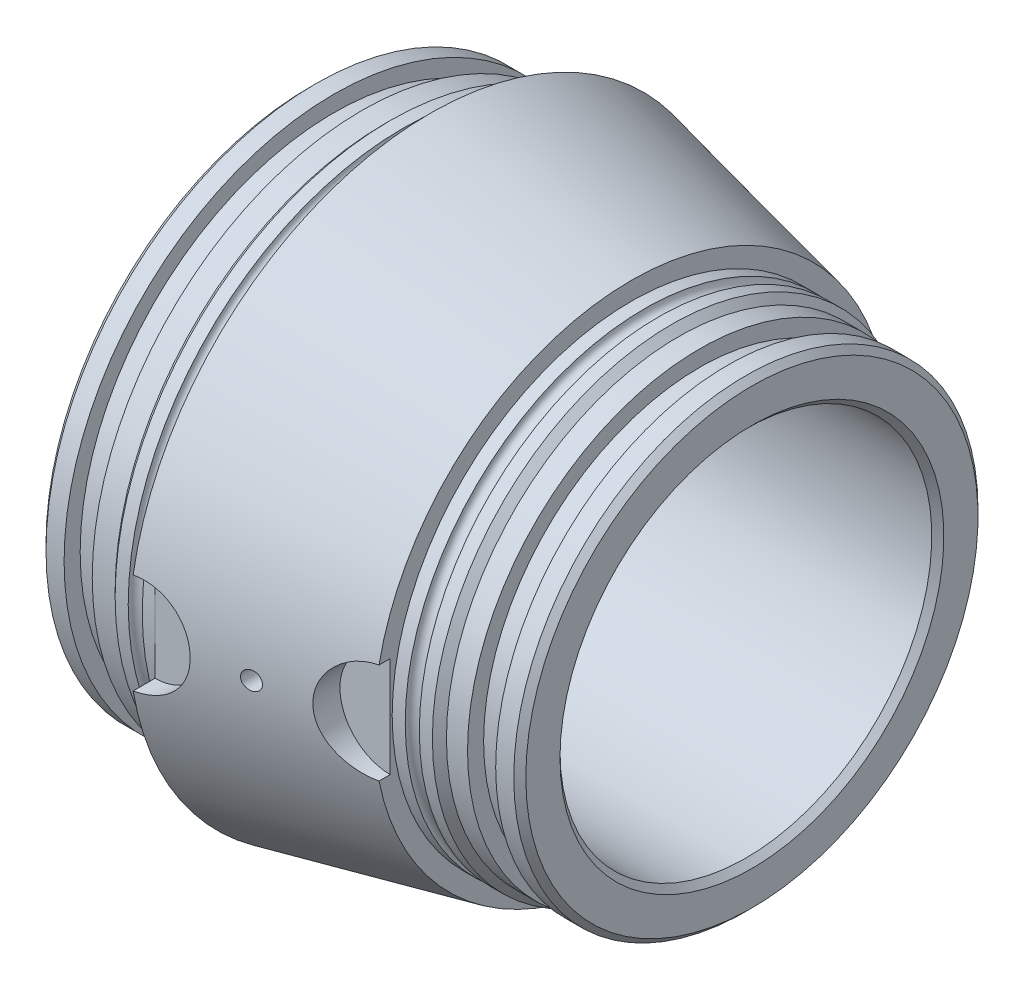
ISO-10303-21;
HEADER;
FILE_DESCRIPTION(('STEP AP214'),'2;1');
FILE_NAME('part.step','',(''),(''),'','','');
FILE_SCHEMA(('AUTOMOTIVE_DESIGN { 1 0 10303 214 1 1 1 1 }'));
ENDSEC;
DATA;
#1=APPLICATION_CONTEXT('core data for automotive mechanical design processes');
#2=APPLICATION_PROTOCOL_DEFINITION('international standard','automotive_design',2000,#1);
#3=PRODUCT_CONTEXT('',#1,'mechanical');
#4=PRODUCT('Part','Part','',(#3));
#5=PRODUCT_RELATED_PRODUCT_CATEGORY('part','',(#4));
#6=PRODUCT_DEFINITION_FORMATION('','',#4);
#7=PRODUCT_DEFINITION_CONTEXT('part definition',#1,'design');
#8=PRODUCT_DEFINITION('design','',#6,#7);
#9=PRODUCT_DEFINITION_SHAPE('','',#8);
#10=(LENGTH_UNIT() NAMED_UNIT(*) SI_UNIT(.MILLI.,.METRE.));
#11=(NAMED_UNIT(*) PLANE_ANGLE_UNIT() SI_UNIT($,.RADIAN.));
#12=(NAMED_UNIT(*) SI_UNIT($,.STERADIAN.) SOLID_ANGLE_UNIT());
#13=UNCERTAINTY_MEASURE_WITH_UNIT(LENGTH_MEASURE(1.E-05),#10,'distance_accuracy_value','');
#14=(GEOMETRIC_REPRESENTATION_CONTEXT(3) GLOBAL_UNCERTAINTY_ASSIGNED_CONTEXT((#13)) GLOBAL_UNIT_ASSIGNED_CONTEXT((#10,
#11,#12)) REPRESENTATION_CONTEXT('',''));
#15=CARTESIAN_POINT('',(0.,0.,0.));
#16=DIRECTION('',(0.,0.,1.));
#17=DIRECTION('',(1.,0.,0.));
#18=AXIS2_PLACEMENT_3D('',#15,#16,#17);
#19=CARTESIAN_POINT('',(0.,0.,0.));
#20=DIRECTION('',(-1.,0.,0.));
#21=DIRECTION('',(0.,0.,1.));
#22=AXIS2_PLACEMENT_3D('',#19,#20,#21);
#23=CONICAL_SURFACE('',#22,32.512,0.216550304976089);
#24=CARTESIAN_POINT('',(-25.4002,-6.34999999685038,37.5671512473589));
#25=CARTESIAN_POINT('',(-25.2239974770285,-6.35002386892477,37.5278230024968));
#26=CARTESIAN_POINT('',(-25.0475169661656,-6.34267756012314,37.4896959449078));
#27=CARTESIAN_POINT('',(-24.6952205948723,-6.31323789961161,37.4160715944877));
#28=CARTESIAN_POINT('',(-24.5194048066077,-6.29114299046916,37.3805745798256));
#29=CARTESIAN_POINT('',(-24.1697028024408,-6.23220054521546,37.3124473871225));
#30=CARTESIAN_POINT('',(-23.9958165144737,-6.19535356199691,37.2798171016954));
#31=CARTESIAN_POINT('',(-23.6512532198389,-6.10704582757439,37.2175698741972));
#32=CARTESIAN_POINT('',(-23.4805760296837,-6.05558591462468,37.1879527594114));
#33=CARTESIAN_POINT('',(-23.1435218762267,-5.93823923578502,37.1317789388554));
#34=CARTESIAN_POINT('',(-22.9771497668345,-5.872336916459,37.1052255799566));
#35=CARTESIAN_POINT('',(-22.6501172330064,-5.72649204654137,37.0552141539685));
#36=CARTESIAN_POINT('',(-22.4894589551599,-5.64654428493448,37.0317572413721));
#37=CARTESIAN_POINT('',(-22.1753124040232,-5.4732115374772,36.9879084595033));
#38=CARTESIAN_POINT('',(-22.0218178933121,-5.37983854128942,36.967513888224));
#39=CARTESIAN_POINT('',(-21.722994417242,-5.1801958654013,36.9296341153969));
#40=CARTESIAN_POINT('',(-21.5776684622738,-5.07392147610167,36.9121499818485));
#41=CARTESIAN_POINT('',(-21.2986594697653,-4.85106866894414,36.880183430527));
#42=CARTESIAN_POINT('',(-21.164826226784,-4.73468453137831,36.8656570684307));
#43=CARTESIAN_POINT('',(-20.9071917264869,-4.49094983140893,36.8390435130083));
#44=CARTESIAN_POINT('',(-20.783394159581,-4.36359527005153,36.8269572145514));
#45=CARTESIAN_POINT('',(-20.5468337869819,-4.09887583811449,36.8049951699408));
#46=CARTESIAN_POINT('',(-20.4340694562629,-3.96151235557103,36.795119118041));
#47=CARTESIAN_POINT('',(-20.2203561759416,-3.67768398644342,36.777320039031));
#48=CARTESIAN_POINT('',(-20.1194116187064,-3.53121574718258,36.7693977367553));
#49=CARTESIAN_POINT('',(-19.9304586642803,-3.23078923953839,36.7552804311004));
#50=CARTESIAN_POINT('',(-19.8424068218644,-3.07685856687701,36.7490795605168));
#51=CARTESIAN_POINT('',(-19.6794349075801,-2.76207507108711,36.7381240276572));
#52=CARTESIAN_POINT('',(-19.6045196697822,-2.60121972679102,36.7333698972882));
#53=CARTESIAN_POINT('',(-19.4684311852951,-2.27385138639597,36.7250899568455));
#54=CARTESIAN_POINT('',(-19.4072518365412,-2.10734094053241,36.7215636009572));
#55=CARTESIAN_POINT('',(-19.299010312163,-1.76970752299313,36.7155425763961));
#56=CARTESIAN_POINT('',(-19.2519533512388,-1.59858287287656,36.7130482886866));
#57=CARTESIAN_POINT('',(-19.1721761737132,-1.25235213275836,36.7089309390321));
#58=CARTESIAN_POINT('',(-19.1395091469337,-1.07723374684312,36.7073111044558));
#59=CARTESIAN_POINT('',(-19.0889973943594,-0.724862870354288,36.704845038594));
#60=CARTESIAN_POINT('',(-19.0711530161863,-0.547610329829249,36.7039988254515));
#61=CARTESIAN_POINT('',(-19.0504147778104,-0.192225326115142,36.7030179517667));
#62=CARTESIAN_POINT('',(-19.0475213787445,-0.0140928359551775,36.7028833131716));
#63=CARTESIAN_POINT('',(-19.0567069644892,0.341784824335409,36.7033155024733));
#64=CARTESIAN_POINT('',(-19.0687859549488,0.519529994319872,36.7038823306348));
#65=CARTESIAN_POINT('',(-19.1078645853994,0.873685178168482,36.7057613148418));
#66=CARTESIAN_POINT('',(-19.1348904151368,1.05009229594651,36.707074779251));
#67=CARTESIAN_POINT('',(-19.2036863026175,1.3999954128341,36.7105413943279));
#68=CARTESIAN_POINT('',(-19.2454560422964,1.57349147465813,36.712694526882));
#69=CARTESIAN_POINT('',(-19.3434490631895,1.91637406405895,36.7179817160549));
#70=CARTESIAN_POINT('',(-19.3996751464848,2.08575978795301,36.7211159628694));
#71=CARTESIAN_POINT('',(-19.5261471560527,2.419115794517,36.7285462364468));
#72=CARTESIAN_POINT('',(-19.5963878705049,2.58308806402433,36.7328418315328));
#73=CARTESIAN_POINT('',(-19.7503718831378,2.9044694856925,36.7428100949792));
#74=CARTESIAN_POINT('',(-19.834111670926,3.06188033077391,36.7484824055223));
#75=CARTESIAN_POINT('',(-20.0144602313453,3.36900006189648,36.7614427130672));
#76=CARTESIAN_POINT('',(-20.111064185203,3.51871180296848,36.768730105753));
#77=CARTESIAN_POINT('',(-20.3164844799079,3.80947032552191,36.7851783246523));
#78=CARTESIAN_POINT('',(-20.4253046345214,3.95051437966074,36.7943397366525));
#79=CARTESIAN_POINT('',(-20.6542785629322,4.22282625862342,36.8147868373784));
#80=CARTESIAN_POINT('',(-20.7744280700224,4.35409773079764,36.8260717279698));
#81=CARTESIAN_POINT('',(-21.0247990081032,4.60559462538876,36.8509740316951));
#82=CARTESIAN_POINT('',(-21.1549877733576,4.72585330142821,36.8645840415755));
#83=CARTESIAN_POINT('',(-21.424733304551,4.95490154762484,36.8943747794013));
#84=CARTESIAN_POINT('',(-21.5642865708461,5.06369536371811,36.9105545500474));
#85=CARTESIAN_POINT('',(-21.8518246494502,5.26917386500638,36.945681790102));
#86=CARTESIAN_POINT('',(-21.9998139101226,5.36585207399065,36.9646307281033));
#87=CARTESIAN_POINT('',(-22.302978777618,5.54635655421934,37.0054205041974));
#88=CARTESIAN_POINT('',(-22.4581517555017,5.63018747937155,37.0272602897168));
#89=CARTESIAN_POINT('',(-22.7744166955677,5.78443936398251,37.0738980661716));
#90=CARTESIAN_POINT('',(-22.9355030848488,5.85487258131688,37.0986933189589));
#91=CARTESIAN_POINT('',(-23.262470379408,5.9819915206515,37.1512693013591));
#92=CARTESIAN_POINT('',(-23.4283495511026,6.03868214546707,37.1790489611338));
#93=CARTESIAN_POINT('',(-23.7636213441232,6.13802208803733,37.2375348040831));
#94=CARTESIAN_POINT('',(-23.93301143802,6.1806811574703,37.2682389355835));
#95=CARTESIAN_POINT('',(-24.2741491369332,6.25182396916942,37.3324680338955));
#96=CARTESIAN_POINT('',(-24.4458957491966,6.28031350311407,37.3659918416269));
#97=CARTESIAN_POINT('',(-24.7483321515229,6.31783339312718,37.427144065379));
#98=CARTESIAN_POINT('',(-24.8787671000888,6.32992175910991,37.4542034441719));
#99=CARTESIAN_POINT('',(-25.1395808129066,6.34600108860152,37.5096766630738));
#100=CARTESIAN_POINT('',(-25.2699591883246,6.35000783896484,37.5380877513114));
#101=CARTESIAN_POINT('',(-25.4002,6.34999999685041,37.5671512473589));
#102=B_SPLINE_CURVE_WITH_KNOTS('',3,(#24,#25,#26,#27,#28,#29,#30,#31,#32,#33,#34,#35,#36,#37,
#38,#39,#40,#41,#42,#43,#44,#45,#46,#47,#48,#49,#50,#51,#52,#53,#54,#55,#56,#57,#58,#59,#60,#61,
#62,#63,#64,#65,#66,#67,#68,#69,#70,#71,#72,#73,#74,#75,#76,#77,#78,#79,#80,#81,#82,#83,#84,#85,
#86,#87,#88,#89,#90,#91,#92,#93,#94,#95,#96,#97,#98,#99,#100,#101),.UNSPECIFIED.,.F.,.F.,(4,2,2,
2,2,2,2,2,2,2,2,2,2,2,2,2,2,2,2,2,2,2,2,2,2,2,2,2,2,2,2,2,2,2,2,2,2,2,4),(0.,0.541474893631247,
1.08300697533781,1.62451876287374,2.16599949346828,2.70806625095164,3.25033454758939,
3.79212153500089,4.33410689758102,4.86733322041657,5.40075474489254,5.93410243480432,
6.46764769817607,6.99935149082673,7.53125053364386,8.06291281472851,8.59477117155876,
9.12857928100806,9.66239990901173,10.1962370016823,10.7300742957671,11.2648499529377,
11.7996140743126,12.3344819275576,12.8691512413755,13.403681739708,13.9380125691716,
14.4725106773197,15.0068082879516,15.539435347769,16.0718644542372,16.6045769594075,
17.137096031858,17.6691255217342,18.2009649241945,18.7324339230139,19.2636855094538,
19.6647228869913,20.064976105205),.UNSPECIFIED.);
#103=CARTESIAN_POINT('',(-25.4,-6.34999999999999,37.5671066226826));
#104=VERTEX_POINT('',#103);
#105=CARTESIAN_POINT('',(-25.4,6.35000000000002,37.5671066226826));
#106=VERTEX_POINT('',#105);
#107=EDGE_CURVE('E187',#104,#106,#102,.T.);
#108=ORIENTED_EDGE('',*,*,#107,.F.);
#109=CARTESIAN_POINT('',(-25.4,0.,0.));
#110=DIRECTION('',(-1.,0.,0.));
#111=DIRECTION('',(0.,0.,1.));
#112=AXIS2_PLACEMENT_3D('',#109,#110,#111);
#113=CIRCLE('',#112,38.1);
#114=EDGE_CURVE('E112',#106,#104,#113,.T.);
#115=ORIENTED_EDGE('',*,*,#114,.F.);
#116=EDGE_LOOP('',(#108,#115));
#117=FACE_BOUND('',#116,.T.);
#118=CARTESIAN_POINT('',(0.000200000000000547,6.34999999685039,31.8858084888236));
#119=CARTESIAN_POINT('',(-0.184691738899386,6.35002215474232,31.927266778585));
#120=CARTESIAN_POINT('',(-0.369214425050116,6.34193755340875,31.9702779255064));
#121=CARTESIAN_POINT('',(-0.736193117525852,6.3098636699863,32.0589183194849));
#122=CARTESIAN_POINT('',(-0.918649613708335,6.28587824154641,32.1045469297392));
#123=CARTESIAN_POINT('',(-1.28003891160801,6.22234980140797,32.1978985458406));
#124=CARTESIAN_POINT('',(-1.45897571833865,6.18282569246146,32.2456189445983));
#125=CARTESIAN_POINT('',(-1.81237478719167,6.0886153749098,32.3426574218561));
#126=CARTESIAN_POINT('',(-1.98683683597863,6.03392844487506,32.391975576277));
#127=CARTESIAN_POINT('',(-2.33003328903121,5.90988302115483,32.4915814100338));
#128=CARTESIAN_POINT('',(-2.49877146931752,5.84053442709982,32.5418684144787));
#129=CARTESIAN_POINT('',(-2.82963142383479,5.68761037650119,32.6428323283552));
#130=CARTESIAN_POINT('',(-2.99175074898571,5.60402971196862,32.693509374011));
#131=CARTESIAN_POINT('',(-3.30825646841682,5.42320516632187,32.7945689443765));
#132=CARTESIAN_POINT('',(-3.46264361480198,5.32596261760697,32.8449514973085));
#133=CARTESIAN_POINT('',(-3.76274354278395,5.11835547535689,32.9447585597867));
#134=CARTESIAN_POINT('',(-3.90845330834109,5.00798635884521,32.9941827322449));
#135=CARTESIAN_POINT('',(-4.1922282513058,4.77306499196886,33.0920693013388));
#136=CARTESIAN_POINT('',(-4.33014864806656,4.64832725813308,33.1405066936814));
#137=CARTESIAN_POINT('',(-4.59493343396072,4.38676598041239,33.2349003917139));
#138=CARTESIAN_POINT('',(-4.7217982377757,4.24994289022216,33.2808567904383));
#139=CARTESIAN_POINT('',(-4.9634704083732,3.96501731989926,33.3695452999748));
#140=CARTESIAN_POINT('',(-5.07827600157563,3.81691318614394,33.4122769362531));
#141=CARTESIAN_POINT('',(-5.29474916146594,3.5104566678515,33.4937475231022));
#142=CARTESIAN_POINT('',(-5.39642261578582,3.35210892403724,33.5324882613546));
#143=CARTESIAN_POINT('',(-5.5823968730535,3.03189969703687,33.6040076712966));
#144=CARTESIAN_POINT('',(-5.66718109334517,2.8703550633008,33.636947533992));
#145=CARTESIAN_POINT('',(-5.82279657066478,2.53985873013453,33.6978473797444));
#146=CARTESIAN_POINT('',(-5.89363406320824,2.37091038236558,33.7258095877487));
#147=CARTESIAN_POINT('',(-6.02063762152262,2.02683110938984,33.7762259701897));
#148=CARTESIAN_POINT('',(-6.07680717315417,1.85170166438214,33.7986814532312));
#149=CARTESIAN_POINT('',(-6.17385816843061,1.496611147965,33.8376370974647));
#150=CARTESIAN_POINT('',(-6.21474060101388,1.31665038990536,33.8541376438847));
#151=CARTESIAN_POINT('',(-6.27845952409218,0.965916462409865,33.8799183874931));
#152=CARTESIAN_POINT('',(-6.30234473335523,0.795363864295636,33.8896175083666));
#153=CARTESIAN_POINT('',(-6.33618521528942,0.452658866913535,33.9033724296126));
#154=CARTESIAN_POINT('',(-6.34614115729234,0.280506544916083,33.9074285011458));
#155=CARTESIAN_POINT('',(-6.35201392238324,-0.0640404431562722,33.909820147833));
#156=CARTESIAN_POINT('',(-6.34793364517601,-0.236435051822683,33.9081569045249));
#157=CARTESIAN_POINT('',(-6.32578532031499,-0.580172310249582,33.8991442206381));
#158=CARTESIAN_POINT('',(-6.3077174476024,-0.751514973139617,33.891794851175));
#159=CARTESIAN_POINT('',(-6.25874901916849,-1.08532024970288,33.8719375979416));
#160=CARTESIAN_POINT('',(-6.22836641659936,-1.24787164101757,33.8596380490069));
#161=CARTESIAN_POINT('',(-6.15513331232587,-1.56973984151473,33.8301152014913));
#162=CARTESIAN_POINT('',(-6.11227870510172,-1.7290555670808,33.8128902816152));
#163=CARTESIAN_POINT('',(-6.01452226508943,-2.04330420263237,33.7738104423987));
#164=CARTESIAN_POINT('',(-5.95962413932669,-2.19823844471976,33.7519569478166));
#165=CARTESIAN_POINT('',(-5.83823786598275,-2.50287335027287,33.7039570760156));
#166=CARTESIAN_POINT('',(-5.77174533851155,-2.65257201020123,33.6778090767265));
#167=CARTESIAN_POINT('',(-5.62592113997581,-2.94950043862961,33.6209166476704));
#168=CARTESIAN_POINT('',(-5.54630827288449,-3.09657305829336,33.5900730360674));
#169=CARTESIAN_POINT('',(-5.37611482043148,-3.38344806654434,33.5247586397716));
#170=CARTESIAN_POINT('',(-5.28553020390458,-3.52324775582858,33.4902865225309));
#171=CARTESIAN_POINT('',(-5.0941048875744,-3.79475575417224,33.4182259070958));
#172=CARTESIAN_POINT('',(-4.99326604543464,-3.92646552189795,33.3806379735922));
#173=CARTESIAN_POINT('',(-4.78201731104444,-4.18117503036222,33.3028531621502));
#174=CARTESIAN_POINT('',(-4.67160399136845,-4.30417162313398,33.262655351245));
#175=CARTESIAN_POINT('',(-4.31226541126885,-4.67438857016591,33.1336172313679));
#176=CARTESIAN_POINT('',(-4.04753315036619,-4.90530882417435,33.0410348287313));
#177=CARTESIAN_POINT('',(-3.48462904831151,-5.31998005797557,32.8513723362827));
#178=CARTESIAN_POINT('',(-3.18643527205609,-5.50369983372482,32.7542893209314));
#179=CARTESIAN_POINT('',(-2.71148763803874,-5.74492776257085,32.6064189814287));
#180=CARTESIAN_POINT('',(-2.54399893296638,-5.8210330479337,32.5554517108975));
#181=CARTESIAN_POINT('',(-2.20287604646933,-5.95849062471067,32.4542763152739));
#182=CARTESIAN_POINT('',(-2.0292440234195,-6.01984803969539,32.4040679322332));
#183=CARTESIAN_POINT('',(-1.6771674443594,-6.12727153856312,32.3050926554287));
#184=CARTESIAN_POINT('',(-1.49872885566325,-6.17335571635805,32.2563241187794));
#185=CARTESIAN_POINT('',(-1.13808929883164,-6.24989627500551,32.1607601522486));
#186=CARTESIAN_POINT('',(-0.955890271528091,-6.28036051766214,32.1139637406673));
#187=CARTESIAN_POINT('',(-0.644504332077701,-6.31852285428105,32.0366477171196));
#188=CARTESIAN_POINT('',(-0.515964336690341,-6.33032085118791,32.0054887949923));
#189=CARTESIAN_POINT('',(-0.258277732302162,-6.34605675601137,31.9445740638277));
#190=CARTESIAN_POINT('',(-0.12913231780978,-6.35000639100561,31.9148162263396));
#191=CARTESIAN_POINT('',(0.000200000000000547,-6.34999999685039,31.8858084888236));
#192=B_SPLINE_CURVE_WITH_KNOTS('',3,(#118,#119,#120,#121,#122,#123,#124,#125,#126,#127,#128,
#129,#130,#131,#132,#133,#134,#135,#136,#137,#138,#139,#140,#141,#142,#143,#144,#145,#146,#147,
#148,#149,#150,#151,#152,#153,#154,#155,#156,#157,#158,#159,#160,#161,#162,#163,#164,#165,#166,
#167,#168,#169,#170,#171,#172,#173,#174,#175,#176,#177,#178,#179,#180,#181,#182,#183,#184,#185,
#186,#187,#188,#189,#190,#191),.UNSPECIFIED.,.F.,.F.,(4,2,2,2,2,2,2,2,2,2,2,2,2,2,2,2,2,2,2,2,2,
2,2,2,2,2,2,2,2,2,2,2,2,2,2,2,4),(0.,0.568239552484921,1.13634143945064,1.70375436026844,
2.27119428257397,2.83825228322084,3.40551823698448,3.97272890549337,4.54013558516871,
5.11592680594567,5.69169642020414,6.26755059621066,6.84314569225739,7.39859919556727,
7.95380379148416,8.50887632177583,9.06391293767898,9.58073297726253,10.097528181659,
10.6142166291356,11.1308986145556,11.6277932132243,12.1248515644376,12.6217571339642,
13.1188508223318,13.6284647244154,14.1382664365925,14.6479759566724,15.1578686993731,
16.2426728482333,17.328192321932,17.9003175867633,18.4722438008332,19.0434900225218,
19.6144484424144,20.0125849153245,20.410126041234),.UNSPECIFIED.);
#193=CARTESIAN_POINT('',(0.,6.35,31.8858533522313));
#194=VERTEX_POINT('',#193);
#195=CARTESIAN_POINT('',(0.,-6.35,31.8858533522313));
#196=VERTEX_POINT('',#195);
#197=EDGE_CURVE('E92',#194,#196,#192,.T.);
#198=ORIENTED_EDGE('',*,*,#197,.F.);
#199=CARTESIAN_POINT('',(0.,0.,0.));
#200=DIRECTION('',(-1.,0.,0.));
#201=DIRECTION('',(0.,0.,1.));
#202=AXIS2_PLACEMENT_3D('',#199,#200,#201);
#203=CIRCLE('',#202,32.512);
#204=EDGE_CURVE('E97',#194,#196,#203,.T.);
#205=ORIENTED_EDGE('',*,*,#204,.T.);
#206=EDGE_LOOP('',(#198,#205));
#207=FACE_BOUND('',#206,.T.);
#208=CARTESIAN_POINT('',(-13.6580475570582,-0.623372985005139,35.5112994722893));
#209=CARTESIAN_POINT('',(-13.6226280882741,-0.677802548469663,35.5025504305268));
#210=CARTESIAN_POINT('',(-13.5826073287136,-0.729130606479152,35.4927169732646));
#211=CARTESIAN_POINT('',(-13.4946415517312,-0.824134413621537,35.4712808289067));
#212=CARTESIAN_POINT('',(-13.4466843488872,-0.867798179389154,35.4596754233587));
#213=CARTESIAN_POINT('',(-13.3443957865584,-0.946228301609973,35.4351577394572));
#214=CARTESIAN_POINT('',(-13.2900747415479,-0.981008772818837,35.4222475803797));
#215=CARTESIAN_POINT('',(-13.1765622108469,-1.04089172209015,35.3955550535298));
#216=CARTESIAN_POINT('',(-13.1173720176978,-1.06599675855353,35.3817729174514));
#217=CARTESIAN_POINT('',(-12.9946007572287,-1.10630435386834,35.3535129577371));
#218=CARTESIAN_POINT('',(-12.930958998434,-1.12131650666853,35.3390270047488));
#219=CARTESIAN_POINT('',(-12.8020455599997,-1.14029883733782,35.3100438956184));
#220=CARTESIAN_POINT('',(-12.7367736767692,-1.14426762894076,35.2955467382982));
#221=CARTESIAN_POINT('',(-12.605765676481,-1.14101018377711,35.2668153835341));
#222=CARTESIAN_POINT('',(-12.5400313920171,-1.13367230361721,35.2525852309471));
#223=CARTESIAN_POINT('',(-12.4106448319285,-1.1077344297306,35.2249306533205));
#224=CARTESIAN_POINT('',(-12.3469925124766,-1.08913467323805,35.2115062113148));
#225=CARTESIAN_POINT('',(-12.2240899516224,-1.04128592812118,35.1859030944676));
#226=CARTESIAN_POINT('',(-12.164811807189,-1.01211304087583,35.1737162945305));
#227=CARTESIAN_POINT('',(-12.0519627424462,-0.943845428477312,35.1507785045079));
#228=CARTESIAN_POINT('',(-11.9983912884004,-0.904751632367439,35.1400273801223));
#229=CARTESIAN_POINT('',(-11.899530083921,-0.818488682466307,35.1203859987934));
#230=CARTESIAN_POINT('',(-11.8541093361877,-0.771476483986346,35.1114658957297));
#231=CARTESIAN_POINT('',(-11.7718201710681,-0.67021345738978,35.0954376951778));
#232=CARTESIAN_POINT('',(-11.7349508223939,-0.615963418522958,35.0883294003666));
#233=CARTESIAN_POINT('',(-11.6715784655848,-0.502907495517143,35.0761866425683));
#234=CARTESIAN_POINT('',(-11.6448873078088,-0.444211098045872,35.0711144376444));
#235=CARTESIAN_POINT('',(-11.6017173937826,-0.323046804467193,35.0629418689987));
#236=CARTESIAN_POINT('',(-11.5852377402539,-0.260579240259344,35.0598413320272));
#237=CARTESIAN_POINT('',(-11.5631771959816,-0.134593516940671,35.0556963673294));
#238=CARTESIAN_POINT('',(-11.5574459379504,-0.0711025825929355,35.0546235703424));
#239=CARTESIAN_POINT('',(-11.5566042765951,0.0559507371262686,35.0544658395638));
#240=CARTESIAN_POINT('',(-11.5614934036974,0.119513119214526,35.0553808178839));
#241=CARTESIAN_POINT('',(-11.5816827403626,0.244550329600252,35.0591727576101));
#242=CARTESIAN_POINT('',(-11.5969271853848,0.306034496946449,35.0620392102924));
#243=CARTESIAN_POINT('',(-11.637295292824,0.425541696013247,35.0696741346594));
#244=CARTESIAN_POINT('',(-11.662418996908,0.483564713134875,35.0744426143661));
#245=CARTESIAN_POINT('',(-11.7219012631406,0.594781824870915,35.0858213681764));
#246=CARTESIAN_POINT('',(-11.756298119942,0.647954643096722,35.0924392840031));
#247=CARTESIAN_POINT('',(-11.83323878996,0.747760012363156,35.1073853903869));
#248=CARTESIAN_POINT('',(-11.8757830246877,0.79439222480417,35.1157136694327));
#249=CARTESIAN_POINT('',(-11.9683619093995,0.880454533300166,35.1340357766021));
#250=CARTESIAN_POINT('',(-12.0184859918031,0.919784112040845,35.1440496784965));
#251=CARTESIAN_POINT('',(-12.1243479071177,0.989490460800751,35.1654551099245));
#252=CARTESIAN_POINT('',(-12.1800862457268,1.01986642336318,35.1768467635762));
#253=CARTESIAN_POINT('',(-12.2966901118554,1.0714144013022,35.2009796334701));
#254=CARTESIAN_POINT('',(-12.357632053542,1.09240358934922,35.213742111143));
#255=CARTESIAN_POINT('',(-12.481996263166,1.12384991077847,35.2401266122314));
#256=CARTESIAN_POINT('',(-12.5454187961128,1.13430591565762,35.2537487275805));
#257=CARTESIAN_POINT('',(-12.6742037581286,1.14456691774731,35.2817647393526));
#258=CARTESIAN_POINT('',(-12.7395802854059,1.14416909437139,35.2961683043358));
#259=CARTESIAN_POINT('',(-12.8692887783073,1.13226884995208,35.3251025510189));
#260=CARTESIAN_POINT('',(-12.9336206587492,1.1207655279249,35.3396332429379));
#261=CARTESIAN_POINT('',(-13.0601001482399,1.08678787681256,35.3685331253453));
#262=CARTESIAN_POINT('',(-13.1222188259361,1.06420296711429,35.3828991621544));
#263=CARTESIAN_POINT('',(-13.2417903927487,1.00859278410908,35.410844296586));
#264=CARTESIAN_POINT('',(-13.2992432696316,0.97556748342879,35.4244233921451));
#265=CARTESIAN_POINT('',(-13.4074548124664,0.900155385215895,35.4502336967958));
#266=CARTESIAN_POINT('',(-13.4582513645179,0.857825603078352,35.4624724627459));
#267=CARTESIAN_POINT('',(-13.5519793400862,0.764812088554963,35.4852251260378));
#268=CARTESIAN_POINT('',(-13.5949116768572,0.714129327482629,35.4957392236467));
#269=CARTESIAN_POINT('',(-13.6706425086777,0.607046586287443,35.5143932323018));
#270=CARTESIAN_POINT('',(-13.7036475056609,0.550801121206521,35.5225812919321));
#271=CARTESIAN_POINT('',(-13.7596969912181,0.433274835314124,35.5365407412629));
#272=CARTESIAN_POINT('',(-13.7827436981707,0.371995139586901,35.5423126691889));
#273=CARTESIAN_POINT('',(-13.8175687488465,0.248024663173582,35.5510524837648));
#274=CARTESIAN_POINT('',(-13.8296504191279,0.185424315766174,35.5540958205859));
#275=CARTESIAN_POINT('',(-13.843244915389,0.0589990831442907,35.5575210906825));
#276=CARTESIAN_POINT('',(-13.8447563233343,-0.00482596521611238,35.5579026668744));
#277=CARTESIAN_POINT('',(-13.8372243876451,-0.130677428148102,35.5560040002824));
#278=CARTESIAN_POINT('',(-13.8283650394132,-0.192715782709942,35.5537701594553));
#279=CARTESIAN_POINT('',(-13.8006937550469,-0.314327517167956,35.5468148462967));
#280=CARTESIAN_POINT('',(-13.7818943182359,-0.373903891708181,35.5420964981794));
#281=CARTESIAN_POINT('',(-13.7447742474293,-0.464988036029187,35.5328240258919));
#282=CARTESIAN_POINT('',(-13.7295124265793,-0.497855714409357,35.5290192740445));
#283=CARTESIAN_POINT('',(-13.6959897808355,-0.56192577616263,35.5206877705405));
#284=CARTESIAN_POINT('',(-13.6777290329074,-0.593128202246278,35.5161610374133));
#285=CARTESIAN_POINT('',(-13.6580475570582,-0.623372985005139,35.5112994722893));
#286=B_SPLINE_CURVE_WITH_KNOTS('',3,(#208,#209,#210,#211,#212,#213,#214,#215,#216,#217,#218,
#219,#220,#221,#222,#223,#224,#225,#226,#227,#228,#229,#230,#231,#232,#233,#234,#235,#236,#237,
#238,#239,#240,#241,#242,#243,#244,#245,#246,#247,#248,#249,#250,#251,#252,#253,#254,#255,#256,
#257,#258,#259,#260,#261,#262,#263,#264,#265,#266,#267,#268,#269,#270,#271,#272,#273,#274,#275,
#276,#277,#278,#279,#280,#281,#282,#283,#284,#285),.UNSPECIFIED.,.T.,.F.,(4,2,2,2,2,2,2,2,2,2,2,
2,2,2,2,2,2,2,2,2,2,2,2,2,2,2,2,2,2,2,2,2,2,2,2,2,2,2,4),(0.,0.196440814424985,
0.393186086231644,0.589616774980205,0.785995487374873,0.985982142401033,1.1859939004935,
1.38799329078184,1.58998842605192,1.79055764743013,1.99110809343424,2.18807121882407,
2.38501288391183,2.57811362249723,2.77119739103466,2.96155921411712,3.15191262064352,
3.34124899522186,3.53058616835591,3.72071753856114,3.91085874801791,4.10344938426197,
4.2960573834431,4.49226885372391,4.68850134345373,4.8884032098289,5.08832129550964,
5.29027618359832,5.49223160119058,5.69298237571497,5.89370982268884,6.08991539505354,
6.2860772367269,6.47663076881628,6.66720986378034,6.8544583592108,7.04147195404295,
7.15063068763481,7.2597866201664),.UNSPECIFIED.);
#287=CARTESIAN_POINT('',(-13.6580475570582,-0.623372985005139,35.5112994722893));
#288=VERTEX_POINT('',#287);
#289=EDGE_CURVE('E42',#288,#288,#286,.T.);
#290=ORIENTED_EDGE('',*,*,#289,.F.);
#291=EDGE_LOOP('',(#290));
#292=FACE_BOUND('',#291,.T.);
#293=ADVANCED_FACE('F38',(#117,#207,#292),#23,.T.);
#294=CARTESIAN_POINT('',(0.,0.,0.));
#295=DIRECTION('',(1.,0.,0.));
#296=DIRECTION('',(0.,0.,-1.));
#297=AXIS2_PLACEMENT_3D('',#294,#295,#296);
#298=PLANE('',#297);
#299=CARTESIAN_POINT('',(0.,0.,0.));
#300=DIRECTION('',(-1.,0.,0.));
#301=DIRECTION('',(0.,0.,1.));
#302=AXIS2_PLACEMENT_3D('',#299,#300,#301);
#303=CIRCLE('',#302,30.226);
#304=CARTESIAN_POINT('',(0.,0.,30.226));
#305=VERTEX_POINT('',#304);
#306=EDGE_CURVE('E108',#305,#305,#303,.T.);
#307=ORIENTED_EDGE('',*,*,#306,.T.);
#308=EDGE_LOOP('',(#307));
#309=FACE_BOUND('',#308,.T.);
#310=DIRECTION('',(0.,-1.,0.));
#311=VECTOR('',#310,1.);
#312=CARTESIAN_POINT('',(0.,0.,30.48));
#313=LINE('',#312,#311);
#314=CARTESIAN_POINT('',(0.,6.35,30.48));
#315=VERTEX_POINT('',#314);
#316=CARTESIAN_POINT('',(0.,-6.35,30.48));
#317=VERTEX_POINT('',#316);
#318=EDGE_CURVE('E83',#315,#317,#313,.T.);
#319=ORIENTED_EDGE('',*,*,#318,.T.);
#320=DIRECTION('',(0.,0.,-1.));
#321=VECTOR('',#320,1.);
#322=CARTESIAN_POINT('',(0.,-6.35,37.9359780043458));
#323=LINE('',#322,#321);
#324=EDGE_CURVE('E11',#317,#196,#323,.F.);
#325=ORIENTED_EDGE('',*,*,#324,.T.);
#326=ORIENTED_EDGE('',*,*,#204,.F.);
#327=DIRECTION('',(0.,0.,-1.));
#328=VECTOR('',#327,1.);
#329=CARTESIAN_POINT('',(0.,6.35,37.9359780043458));
#330=LINE('',#329,#328);
#331=EDGE_CURVE('E52',#194,#315,#330,.T.);
#332=ORIENTED_EDGE('',*,*,#331,.T.);
#333=EDGE_LOOP('',(#319,#325,#326,#332));
#334=FACE_BOUND('',#333,.T.);
#335=ADVANCED_FACE('F95',(#309,#334),#298,.T.);
#336=CARTESIAN_POINT('',(-25.4,0.,0.));
#337=DIRECTION('',(1.,0.,0.));
#338=DIRECTION('',(0.,0.,-1.));
#339=AXIS2_PLACEMENT_3D('',#336,#337,#338);
#340=PLANE('',#339);
#341=CARTESIAN_POINT('',(-25.4,0.,0.));
#342=DIRECTION('',(-1.,0.,0.));
#343=DIRECTION('',(0.,0.,1.));
#344=AXIS2_PLACEMENT_3D('',#341,#342,#343);
#345=CIRCLE('',#344,34.7599);
#346=CARTESIAN_POINT('',(-25.4,0.,34.7599));
#347=VERTEX_POINT('',#346);
#348=EDGE_CURVE('E115',#347,#347,#345,.T.);
#349=ORIENTED_EDGE('',*,*,#348,.F.);
#350=EDGE_LOOP('',(#349));
#351=FACE_BOUND('',#350,.T.);
#352=DIRECTION('',(0.,0.,-1.));
#353=VECTOR('',#352,1.);
#354=CARTESIAN_POINT('',(-25.4,-6.34999999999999,38.1));
#355=LINE('',#354,#353);
#356=CARTESIAN_POINT('',(-25.4,-6.34999999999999,34.798));
#357=VERTEX_POINT('',#356);
#358=EDGE_CURVE('E87',#357,#104,#355,.F.);
#359=ORIENTED_EDGE('',*,*,#358,.F.);
#360=DIRECTION('',(0.,-1.,0.));
#361=VECTOR('',#360,1.);
#362=CARTESIAN_POINT('',(-25.4,0.,34.798));
#363=LINE('',#362,#361);
#364=CARTESIAN_POINT('',(-25.4,6.35000000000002,34.798));
#365=VERTEX_POINT('',#364);
#366=EDGE_CURVE('E103',#365,#357,#363,.T.);
#367=ORIENTED_EDGE('',*,*,#366,.F.);
#368=DIRECTION('',(0.,0.,-1.));
#369=VECTOR('',#368,1.);
#370=CARTESIAN_POINT('',(-25.4,6.35000000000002,38.1));
#371=LINE('',#370,#369);
#372=EDGE_CURVE('E101',#106,#365,#371,.T.);
#373=ORIENTED_EDGE('',*,*,#372,.F.);
#374=ORIENTED_EDGE('',*,*,#114,.T.);
#375=EDGE_LOOP('',(#359,#367,#373,#374));
#376=FACE_BOUND('',#375,.T.);
#377=ADVANCED_FACE('F298',(#351,#376),#340,.F.);
#378=CARTESIAN_POINT('',(2.54,0.,0.));
#379=DIRECTION('',(-1.,0.,0.));
#380=DIRECTION('',(0.,0.,1.));
#381=AXIS2_PLACEMENT_3D('',#378,#379,#380);
#382=TOROIDAL_SURFACE('',#381,30.226,0.889);
#383=CARTESIAN_POINT('',(3.429,0.,0.));
#384=DIRECTION('',(-1.,0.,0.));
#385=DIRECTION('',(0.,0.,1.));
#386=AXIS2_PLACEMENT_3D('',#383,#384,#385);
#387=CIRCLE('',#386,30.226);
#388=CARTESIAN_POINT('',(3.429,0.,30.226));
#389=VERTEX_POINT('',#388);
#390=EDGE_CURVE('E184',#389,#389,#387,.T.);
#391=ORIENTED_EDGE('',*,*,#390,.T.);
#392=EDGE_LOOP('',(#391));
#393=FACE_BOUND('',#392,.T.);
#394=CARTESIAN_POINT('',(1.651,0.,0.));
#395=DIRECTION('',(-1.,0.,0.));
#396=DIRECTION('',(0.,0.,1.));
#397=AXIS2_PLACEMENT_3D('',#394,#395,#396);
#398=CIRCLE('',#397,30.226);
#399=CARTESIAN_POINT('',(1.651,0.,30.226));
#400=VERTEX_POINT('',#399);
#401=EDGE_CURVE('E105',#400,#400,#398,.T.);
#402=ORIENTED_EDGE('',*,*,#401,.F.);
#403=EDGE_LOOP('',(#402));
#404=FACE_BOUND('',#403,.T.);
#405=ADVANCED_FACE('F40',(#393,#404),#382,.F.);
#406=CARTESIAN_POINT('',(-43.0591254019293,0.,0.));
#407=DIRECTION('',(-1.,0.,0.));
#408=DIRECTION('',(0.,0.,1.));
#409=AXIS2_PLACEMENT_3D('',#406,#407,#408);
#410=CYLINDRICAL_SURFACE('',#409,30.226);
#411=ORIENTED_EDGE('',*,*,#306,.F.);
#412=EDGE_LOOP('',(#411));
#413=FACE_BOUND('',#412,.T.);
#414=ORIENTED_EDGE('',*,*,#401,.T.);
#415=EDGE_LOOP('',(#414));
#416=FACE_BOUND('',#415,.T.);
#417=ADVANCED_FACE('F296',(#413,#416),#410,.T.);
#418=CARTESIAN_POINT('',(-43.0591254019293,0.,0.));
#419=DIRECTION('',(-1.,0.,0.));
#420=DIRECTION('',(0.,0.,1.));
#421=AXIS2_PLACEMENT_3D('',#418,#419,#420);
#422=CYLINDRICAL_SURFACE('',#421,34.7599);
#423=ORIENTED_EDGE('',*,*,#348,.T.);
#424=EDGE_LOOP('',(#423));
#425=FACE_BOUND('',#424,.T.);
#426=CARTESIAN_POINT('',(-27.051,0.,0.));
#427=DIRECTION('',(-1.,0.,0.));
#428=DIRECTION('',(0.,0.,1.));
#429=AXIS2_PLACEMENT_3D('',#426,#427,#428);
#430=CIRCLE('',#429,34.7599);
#431=CARTESIAN_POINT('',(-27.051,0.,34.7599));
#432=VERTEX_POINT('',#431);
#433=EDGE_CURVE('E118',#432,#432,#430,.T.);
#434=ORIENTED_EDGE('',*,*,#433,.F.);
#435=EDGE_LOOP('',(#434));
#436=FACE_BOUND('',#435,.T.);
#437=ADVANCED_FACE('F293',(#425,#436),#422,.T.);
#438=CARTESIAN_POINT('',(-27.94,0.,0.));
#439=DIRECTION('',(-1.,0.,0.));
#440=DIRECTION('',(0.,0.,1.));
#441=AXIS2_PLACEMENT_3D('',#438,#439,#440);
#442=TOROIDAL_SURFACE('',#441,34.7599,0.888999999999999);
#443=CARTESIAN_POINT('',(-28.829,0.,0.));
#444=DIRECTION('',(-1.,0.,0.));
#445=DIRECTION('',(0.,0.,1.));
#446=AXIS2_PLACEMENT_3D('',#443,#444,#445);
#447=CIRCLE('',#446,34.7599);
#448=CARTESIAN_POINT('',(-28.829,0.,34.7599));
#449=VERTEX_POINT('',#448);
#450=EDGE_CURVE('E121',#449,#449,#447,.T.);
#451=ORIENTED_EDGE('',*,*,#450,.F.);
#452=EDGE_LOOP('',(#451));
#453=FACE_BOUND('',#452,.T.);
#454=ORIENTED_EDGE('',*,*,#433,.T.);
#455=EDGE_LOOP('',(#454));
#456=FACE_BOUND('',#455,.T.);
#457=ADVANCED_FACE('F289',(#453,#456),#442,.F.);
#458=CARTESIAN_POINT('',(-43.0591254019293,0.,0.));
#459=DIRECTION('',(-1.,0.,0.));
#460=DIRECTION('',(0.,0.,1.));
#461=AXIS2_PLACEMENT_3D('',#458,#459,#460);
#462=CYLINDRICAL_SURFACE('',#461,34.7599);
#463=ORIENTED_EDGE('',*,*,#450,.T.);
#464=EDGE_LOOP('',(#463));
#465=FACE_BOUND('',#464,.T.);
#466=CARTESIAN_POINT('',(-30.48,0.,0.));
#467=DIRECTION('',(-1.,0.,0.));
#468=DIRECTION('',(0.,0.,1.));
#469=AXIS2_PLACEMENT_3D('',#466,#467,#468);
#470=CIRCLE('',#469,34.7599);
#471=CARTESIAN_POINT('',(-30.48,0.,34.7599));
#472=VERTEX_POINT('',#471);
#473=EDGE_CURVE('E124',#472,#472,#470,.T.);
#474=ORIENTED_EDGE('',*,*,#473,.F.);
#475=EDGE_LOOP('',(#474));
#476=FACE_BOUND('',#475,.T.);
#477=ADVANCED_FACE('F285',(#465,#476),#462,.T.);
#478=CARTESIAN_POINT('',(-31.1404,0.,0.));
#479=DIRECTION('',(1.,0.,0.));
#480=DIRECTION('',(0.,0.,-1.));
#481=AXIS2_PLACEMENT_3D('',#478,#479,#480);
#482=CONICAL_SURFACE('',#481,34.0995,0.785398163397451);
#483=ORIENTED_EDGE('',*,*,#473,.T.);
#484=EDGE_LOOP('',(#483));
#485=FACE_BOUND('',#484,.T.);
#486=CARTESIAN_POINT('',(-31.1404,0.,0.));
#487=DIRECTION('',(-1.,0.,0.));
#488=DIRECTION('',(0.,0.,1.));
#489=AXIS2_PLACEMENT_3D('',#486,#487,#488);
#490=CIRCLE('',#489,34.0995);
#491=CARTESIAN_POINT('',(-31.1404,0.,34.0995));
#492=VERTEX_POINT('',#491);
#493=EDGE_CURVE('E127',#492,#492,#490,.T.);
#494=ORIENTED_EDGE('',*,*,#493,.F.);
#495=EDGE_LOOP('',(#494));
#496=FACE_BOUND('',#495,.T.);
#497=ADVANCED_FACE('F281',(#485,#496),#482,.T.);
#498=CARTESIAN_POINT('',(-43.0591254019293,0.,0.));
#499=DIRECTION('',(-1.,0.,0.));
#500=DIRECTION('',(0.,0.,1.));
#501=AXIS2_PLACEMENT_3D('',#498,#499,#500);
#502=CYLINDRICAL_SURFACE('',#501,34.0995);
#503=ORIENTED_EDGE('',*,*,#493,.T.);
#504=EDGE_LOOP('',(#503));
#505=FACE_BOUND('',#504,.T.);
#506=CARTESIAN_POINT('',(-34.036,0.,0.));
#507=DIRECTION('',(-1.,0.,0.));
#508=DIRECTION('',(0.,0.,1.));
#509=AXIS2_PLACEMENT_3D('',#506,#507,#508);
#510=CIRCLE('',#509,34.0995);
#511=CARTESIAN_POINT('',(-34.036,0.,34.0995));
#512=VERTEX_POINT('',#511);
#513=EDGE_CURVE('E130',#512,#512,#510,.T.);
#514=ORIENTED_EDGE('',*,*,#513,.F.);
#515=EDGE_LOOP('',(#514));
#516=FACE_BOUND('',#515,.T.);
#517=ADVANCED_FACE('F277',(#505,#516),#502,.T.);
#518=CARTESIAN_POINT('',(-34.036,0.,0.));
#519=DIRECTION('',(-1.,0.,0.));
#520=DIRECTION('',(0.,0.,1.));
#521=AXIS2_PLACEMENT_3D('',#518,#519,#520);
#522=PLANE('',#521);
#523=ORIENTED_EDGE('',*,*,#513,.T.);
#524=EDGE_LOOP('',(#523));
#525=FACE_BOUND('',#524,.T.);
#526=CARTESIAN_POINT('',(-34.036,0.,0.));
#527=DIRECTION('',(-1.,0.,0.));
#528=DIRECTION('',(0.,0.,1.));
#529=AXIS2_PLACEMENT_3D('',#526,#527,#528);
#530=CIRCLE('',#529,32.0675);
#531=CARTESIAN_POINT('',(-34.036,0.,32.0675));
#532=VERTEX_POINT('',#531);
#533=EDGE_CURVE('E133',#532,#532,#530,.T.);
#534=ORIENTED_EDGE('',*,*,#533,.F.);
#535=EDGE_LOOP('',(#534));
#536=FACE_BOUND('',#535,.T.);
#537=ADVANCED_FACE('F273',(#525,#536),#522,.T.);
#538=CARTESIAN_POINT('',(-43.0591254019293,0.,0.));
#539=DIRECTION('',(-1.,0.,0.));
#540=DIRECTION('',(0.,0.,1.));
#541=AXIS2_PLACEMENT_3D('',#538,#539,#540);
#542=CYLINDRICAL_SURFACE('',#541,32.0675);
#543=ORIENTED_EDGE('',*,*,#533,.T.);
#544=EDGE_LOOP('',(#543));
#545=FACE_BOUND('',#544,.T.);
#546=CARTESIAN_POINT('',(-37.592,0.,0.));
#547=DIRECTION('',(-1.,0.,0.));
#548=DIRECTION('',(0.,0.,1.));
#549=AXIS2_PLACEMENT_3D('',#546,#547,#548);
#550=CIRCLE('',#549,32.0675);
#551=CARTESIAN_POINT('',(-37.592,0.,32.0675));
#552=VERTEX_POINT('',#551);
#553=EDGE_CURVE('E136',#552,#552,#550,.T.);
#554=ORIENTED_EDGE('',*,*,#553,.F.);
#555=EDGE_LOOP('',(#554));
#556=FACE_BOUND('',#555,.T.);
#557=ADVANCED_FACE('F269',(#545,#556),#542,.T.);
#558=CARTESIAN_POINT('',(-37.592,0.,0.));
#559=DIRECTION('',(1.,0.,0.));
#560=DIRECTION('',(0.,0.,-1.));
#561=AXIS2_PLACEMENT_3D('',#558,#559,#560);
#562=PLANE('',#561);
#563=ORIENTED_EDGE('',*,*,#553,.T.);
#564=EDGE_LOOP('',(#563));
#565=FACE_BOUND('',#564,.T.);
#566=CARTESIAN_POINT('',(-37.592,0.,0.));
#567=DIRECTION('',(-1.,0.,0.));
#568=DIRECTION('',(0.,0.,1.));
#569=AXIS2_PLACEMENT_3D('',#566,#567,#568);
#570=CIRCLE('',#569,34.0995);
#571=CARTESIAN_POINT('',(-37.592,0.,34.0995));
#572=VERTEX_POINT('',#571);
#573=EDGE_CURVE('E139',#572,#572,#570,.T.);
#574=ORIENTED_EDGE('',*,*,#573,.F.);
#575=EDGE_LOOP('',(#574));
#576=FACE_BOUND('',#575,.T.);
#577=ADVANCED_FACE('F265',(#565,#576),#562,.T.);
#578=CARTESIAN_POINT('',(-43.0591254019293,0.,0.));
#579=DIRECTION('',(-1.,0.,0.));
#580=DIRECTION('',(0.,0.,1.));
#581=AXIS2_PLACEMENT_3D('',#578,#579,#580);
#582=CYLINDRICAL_SURFACE('',#581,34.0995);
#583=ORIENTED_EDGE('',*,*,#573,.T.);
#584=EDGE_LOOP('',(#583));
#585=FACE_BOUND('',#584,.T.);
#586=CARTESIAN_POINT('',(-39.878,0.,0.));
#587=DIRECTION('',(-1.,0.,0.));
#588=DIRECTION('',(0.,0.,1.));
#589=AXIS2_PLACEMENT_3D('',#586,#587,#588);
#590=CIRCLE('',#589,34.0995);
#591=CARTESIAN_POINT('',(-39.878,0.,34.0995));
#592=VERTEX_POINT('',#591);
#593=EDGE_CURVE('E142',#592,#592,#590,.T.);
#594=ORIENTED_EDGE('',*,*,#593,.F.);
#595=EDGE_LOOP('',(#594));
#596=FACE_BOUND('',#595,.T.);
#597=ADVANCED_FACE('F261',(#585,#596),#582,.T.);
#598=CARTESIAN_POINT('',(-39.878,0.,0.));
#599=DIRECTION('',(1.,0.,0.));
#600=DIRECTION('',(0.,0.,-1.));
#601=AXIS2_PLACEMENT_3D('',#598,#599,#600);
#602=CONICAL_SURFACE('',#601,34.0995,0.785398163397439);
#603=CARTESIAN_POINT('',(-40.64,0.,0.));
#604=DIRECTION('',(-1.,0.,0.));
#605=DIRECTION('',(0.,0.,1.));
#606=AXIS2_PLACEMENT_3D('',#603,#604,#605);
#607=CIRCLE('',#606,33.3375);
#608=CARTESIAN_POINT('',(-40.64,0.,33.3375));
#609=VERTEX_POINT('',#608);
#610=EDGE_CURVE('E145',#609,#609,#607,.T.);
#611=ORIENTED_EDGE('',*,*,#610,.F.);
#612=EDGE_LOOP('',(#611));
#613=FACE_BOUND('',#612,.T.);
#614=ORIENTED_EDGE('',*,*,#593,.T.);
#615=EDGE_LOOP('',(#614));
#616=FACE_BOUND('',#615,.T.);
#617=ADVANCED_FACE('F257',(#613,#616),#602,.T.);
#618=CARTESIAN_POINT('',(-40.64,0.,0.));
#619=DIRECTION('',(-1.,0.,0.));
#620=DIRECTION('',(0.,0.,1.));
#621=AXIS2_PLACEMENT_3D('',#618,#619,#620);
#622=PLANE('',#621);
#623=ORIENTED_EDGE('',*,*,#610,.T.);
#624=EDGE_LOOP('',(#623));
#625=FACE_BOUND('',#624,.T.);
#626=CARTESIAN_POINT('',(-40.64,0.,0.));
#627=DIRECTION('',(-1.,0.,0.));
#628=DIRECTION('',(0.,0.,1.));
#629=AXIS2_PLACEMENT_3D('',#626,#627,#628);
#630=CIRCLE('',#629,24.257);
#631=CARTESIAN_POINT('',(-40.64,0.,24.257));
#632=VERTEX_POINT('',#631);
#633=EDGE_CURVE('E148',#632,#632,#630,.T.);
#634=ORIENTED_EDGE('',*,*,#633,.F.);
#635=EDGE_LOOP('',(#634));
#636=FACE_BOUND('',#635,.T.);
#637=ADVANCED_FACE('F253',(#625,#636),#622,.T.);
#638=CARTESIAN_POINT('',(-40.64,0.,0.));
#639=DIRECTION('',(-1.,0.,0.));
#640=DIRECTION('',(0.,0.,1.));
#641=AXIS2_PLACEMENT_3D('',#638,#639,#640);
#642=CONICAL_SURFACE('',#641,24.257,0.785398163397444);
#643=CARTESIAN_POINT('',(-39.878,0.,0.));
#644=DIRECTION('',(-1.,0.,0.));
#645=DIRECTION('',(0.,0.,1.));
#646=AXIS2_PLACEMENT_3D('',#643,#644,#645);
#647=CIRCLE('',#646,23.495);
#648=CARTESIAN_POINT('',(-39.878,0.,23.495));
#649=VERTEX_POINT('',#648);
#650=EDGE_CURVE('E151',#649,#649,#647,.T.);
#651=ORIENTED_EDGE('',*,*,#650,.F.);
#652=EDGE_LOOP('',(#651));
#653=FACE_BOUND('',#652,.T.);
#654=ORIENTED_EDGE('',*,*,#633,.T.);
#655=EDGE_LOOP('',(#654));
#656=FACE_BOUND('',#655,.T.);
#657=ADVANCED_FACE('F249',(#653,#656),#642,.F.);
#658=CARTESIAN_POINT('',(-43.0591254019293,0.,0.));
#659=DIRECTION('',(-1.,0.,0.));
#660=DIRECTION('',(0.,0.,1.));
#661=AXIS2_PLACEMENT_3D('',#658,#659,#660);
#662=CYLINDRICAL_SURFACE('',#661,23.495);
#663=CARTESIAN_POINT('',(14.478,0.,0.));
#664=DIRECTION('',(-1.,0.,0.));
#665=DIRECTION('',(0.,0.,1.));
#666=AXIS2_PLACEMENT_3D('',#663,#664,#665);
#667=CIRCLE('',#666,23.495);
#668=CARTESIAN_POINT('',(14.478,0.,23.495));
#669=VERTEX_POINT('',#668);
#670=EDGE_CURVE('E154',#669,#669,#667,.T.);
#671=ORIENTED_EDGE('',*,*,#670,.F.);
#672=EDGE_LOOP('',(#671));
#673=FACE_BOUND('',#672,.T.);
#674=ORIENTED_EDGE('',*,*,#650,.T.);
#675=EDGE_LOOP('',(#674));
#676=FACE_BOUND('',#675,.T.);
#677=ADVANCED_FACE('F245',(#673,#676),#662,.F.);
#678=CARTESIAN_POINT('',(14.478,0.,0.));
#679=DIRECTION('',(1.,0.,0.));
#680=DIRECTION('',(0.,0.,-1.));
#681=AXIS2_PLACEMENT_3D('',#678,#679,#680);
#682=CONICAL_SURFACE('',#681,23.495,0.785398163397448);
#683=CARTESIAN_POINT('',(15.24,0.,0.));
#684=DIRECTION('',(-1.,0.,0.));
#685=DIRECTION('',(0.,0.,1.));
#686=AXIS2_PLACEMENT_3D('',#683,#684,#685);
#687=CIRCLE('',#686,24.257);
#688=CARTESIAN_POINT('',(15.24,0.,24.257));
#689=VERTEX_POINT('',#688);
#690=EDGE_CURVE('E157',#689,#689,#687,.T.);
#691=ORIENTED_EDGE('',*,*,#690,.F.);
#692=EDGE_LOOP('',(#691));
#693=FACE_BOUND('',#692,.T.);
#694=ORIENTED_EDGE('',*,*,#670,.T.);
#695=EDGE_LOOP('',(#694));
#696=FACE_BOUND('',#695,.T.);
#697=ADVANCED_FACE('F241',(#693,#696),#682,.F.);
#698=CARTESIAN_POINT('',(15.24,0.,0.));
#699=DIRECTION('',(-1.,0.,0.));
#700=DIRECTION('',(0.,0.,1.));
#701=AXIS2_PLACEMENT_3D('',#698,#699,#700);
#702=PLANE('',#701);
#703=CARTESIAN_POINT('',(15.24,0.,0.));
#704=DIRECTION('',(-1.,0.,0.));
#705=DIRECTION('',(0.,0.,1.));
#706=AXIS2_PLACEMENT_3D('',#703,#704,#705);
#707=CIRCLE('',#706,28.575);
#708=CARTESIAN_POINT('',(15.24,0.,28.575));
#709=VERTEX_POINT('',#708);
#710=EDGE_CURVE('E160',#709,#709,#707,.T.);
#711=ORIENTED_EDGE('',*,*,#710,.F.);
#712=EDGE_LOOP('',(#711));
#713=FACE_BOUND('',#712,.T.);
#714=ORIENTED_EDGE('',*,*,#690,.T.);
#715=EDGE_LOOP('',(#714));
#716=FACE_BOUND('',#715,.T.);
#717=ADVANCED_FACE('F237',(#713,#716),#702,.F.);
#718=CARTESIAN_POINT('',(14.478,0.,0.));
#719=DIRECTION('',(-1.,0.,0.));
#720=DIRECTION('',(0.,0.,1.));
#721=AXIS2_PLACEMENT_3D('',#718,#719,#720);
#722=CONICAL_SURFACE('',#721,29.337,0.785398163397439);
#723=ORIENTED_EDGE('',*,*,#710,.T.);
#724=EDGE_LOOP('',(#723));
#725=FACE_BOUND('',#724,.T.);
#726=CARTESIAN_POINT('',(14.478,0.,0.));
#727=DIRECTION('',(-1.,0.,0.));
#728=DIRECTION('',(0.,0.,1.));
#729=AXIS2_PLACEMENT_3D('',#726,#727,#728);
#730=CIRCLE('',#729,29.337);
#731=CARTESIAN_POINT('',(14.478,0.,29.337));
#732=VERTEX_POINT('',#731);
#733=EDGE_CURVE('E163',#732,#732,#730,.T.);
#734=ORIENTED_EDGE('',*,*,#733,.F.);
#735=EDGE_LOOP('',(#734));
#736=FACE_BOUND('',#735,.T.);
#737=ADVANCED_FACE('F233',(#725,#736),#722,.T.);
#738=CARTESIAN_POINT('',(-43.0591254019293,0.,0.));
#739=DIRECTION('',(-1.,0.,0.));
#740=DIRECTION('',(0.,0.,1.));
#741=AXIS2_PLACEMENT_3D('',#738,#739,#740);
#742=CYLINDRICAL_SURFACE('',#741,29.337);
#743=CARTESIAN_POINT('',(12.192,0.,0.));
#744=DIRECTION('',(-1.,0.,0.));
#745=DIRECTION('',(0.,0.,1.));
#746=AXIS2_PLACEMENT_3D('',#743,#744,#745);
#747=CIRCLE('',#746,29.337);
#748=CARTESIAN_POINT('',(12.192,0.,29.337));
#749=VERTEX_POINT('',#748);
#750=EDGE_CURVE('E166',#749,#749,#747,.T.);
#751=ORIENTED_EDGE('',*,*,#750,.F.);
#752=EDGE_LOOP('',(#751));
#753=FACE_BOUND('',#752,.T.);
#754=ORIENTED_EDGE('',*,*,#733,.T.);
#755=EDGE_LOOP('',(#754));
#756=FACE_BOUND('',#755,.T.);
#757=ADVANCED_FACE('F229',(#753,#756),#742,.T.);
#758=CARTESIAN_POINT('',(12.192,0.,0.));
#759=DIRECTION('',(1.,0.,0.));
#760=DIRECTION('',(0.,0.,-1.));
#761=AXIS2_PLACEMENT_3D('',#758,#759,#760);
#762=PLANE('',#761);
#763=CARTESIAN_POINT('',(12.192,0.,0.));
#764=DIRECTION('',(-1.,0.,0.));
#765=DIRECTION('',(0.,0.,1.));
#766=AXIS2_PLACEMENT_3D('',#763,#764,#765);
#767=CIRCLE('',#766,27.305);
#768=CARTESIAN_POINT('',(12.192,0.,27.305));
#769=VERTEX_POINT('',#768);
#770=EDGE_CURVE('E169',#769,#769,#767,.T.);
#771=ORIENTED_EDGE('',*,*,#770,.F.);
#772=EDGE_LOOP('',(#771));
#773=FACE_BOUND('',#772,.T.);
#774=ORIENTED_EDGE('',*,*,#750,.T.);
#775=EDGE_LOOP('',(#774));
#776=FACE_BOUND('',#775,.T.);
#777=ADVANCED_FACE('F225',(#773,#776),#762,.F.);
#778=CARTESIAN_POINT('',(-43.0591254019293,0.,0.));
#779=DIRECTION('',(-1.,0.,0.));
#780=DIRECTION('',(0.,0.,1.));
#781=AXIS2_PLACEMENT_3D('',#778,#779,#780);
#782=CYLINDRICAL_SURFACE('',#781,27.305);
#783=CARTESIAN_POINT('',(8.63599999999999,0.,0.));
#784=DIRECTION('',(-1.,0.,0.));
#785=DIRECTION('',(0.,0.,1.));
#786=AXIS2_PLACEMENT_3D('',#783,#784,#785);
#787=CIRCLE('',#786,27.305);
#788=CARTESIAN_POINT('',(8.63599999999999,0.,27.305));
#789=VERTEX_POINT('',#788);
#790=EDGE_CURVE('E172',#789,#789,#787,.T.);
#791=ORIENTED_EDGE('',*,*,#790,.F.);
#792=EDGE_LOOP('',(#791));
#793=FACE_BOUND('',#792,.T.);
#794=ORIENTED_EDGE('',*,*,#770,.T.);
#795=EDGE_LOOP('',(#794));
#796=FACE_BOUND('',#795,.T.);
#797=ADVANCED_FACE('F221',(#793,#796),#782,.T.);
#798=CARTESIAN_POINT('',(8.63599999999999,0.,0.));
#799=DIRECTION('',(-1.,0.,0.));
#800=DIRECTION('',(0.,0.,1.));
#801=AXIS2_PLACEMENT_3D('',#798,#799,#800);
#802=PLANE('',#801);
#803=CARTESIAN_POINT('',(8.63599999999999,0.,0.));
#804=DIRECTION('',(-1.,0.,0.));
#805=DIRECTION('',(0.,0.,1.));
#806=AXIS2_PLACEMENT_3D('',#803,#804,#805);
#807=CIRCLE('',#806,29.337);
#808=CARTESIAN_POINT('',(8.63599999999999,0.,29.337));
#809=VERTEX_POINT('',#808);
#810=EDGE_CURVE('E175',#809,#809,#807,.T.);
#811=ORIENTED_EDGE('',*,*,#810,.F.);
#812=EDGE_LOOP('',(#811));
#813=FACE_BOUND('',#812,.T.);
#814=ORIENTED_EDGE('',*,*,#790,.T.);
#815=EDGE_LOOP('',(#814));
#816=FACE_BOUND('',#815,.T.);
#817=ADVANCED_FACE('F217',(#813,#816),#802,.F.);
#818=CARTESIAN_POINT('',(-43.0591254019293,0.,0.));
#819=DIRECTION('',(-1.,0.,0.));
#820=DIRECTION('',(0.,0.,1.));
#821=AXIS2_PLACEMENT_3D('',#818,#819,#820);
#822=CYLINDRICAL_SURFACE('',#821,29.337);
#823=CARTESIAN_POINT('',(5.969,0.,0.));
#824=DIRECTION('',(-1.,0.,0.));
#825=DIRECTION('',(0.,0.,1.));
#826=AXIS2_PLACEMENT_3D('',#823,#824,#825);
#827=CIRCLE('',#826,29.337);
#828=CARTESIAN_POINT('',(5.969,0.,29.337));
#829=VERTEX_POINT('',#828);
#830=EDGE_CURVE('E178',#829,#829,#827,.T.);
#831=ORIENTED_EDGE('',*,*,#830,.F.);
#832=EDGE_LOOP('',(#831));
#833=FACE_BOUND('',#832,.T.);
#834=ORIENTED_EDGE('',*,*,#810,.T.);
#835=EDGE_LOOP('',(#834));
#836=FACE_BOUND('',#835,.T.);
#837=ADVANCED_FACE('F213',(#833,#836),#822,.T.);
#838=CARTESIAN_POINT('',(5.969,0.,0.));
#839=DIRECTION('',(-1.,0.,0.));
#840=DIRECTION('',(0.,0.,1.));
#841=AXIS2_PLACEMENT_3D('',#838,#839,#840);
#842=CONICAL_SURFACE('',#841,29.337,0.785398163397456);
#843=CARTESIAN_POINT('',(5.08000000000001,0.,0.));
#844=DIRECTION('',(-1.,0.,0.));
#845=DIRECTION('',(0.,0.,1.));
#846=AXIS2_PLACEMENT_3D('',#843,#844,#845);
#847=CIRCLE('',#846,30.226);
#848=CARTESIAN_POINT('',(5.08000000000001,0.,30.226));
#849=VERTEX_POINT('',#848);
#850=EDGE_CURVE('E181',#849,#849,#847,.T.);
#851=ORIENTED_EDGE('',*,*,#850,.F.);
#852=EDGE_LOOP('',(#851));
#853=FACE_BOUND('',#852,.T.);
#854=ORIENTED_EDGE('',*,*,#830,.T.);
#855=EDGE_LOOP('',(#854));
#856=FACE_BOUND('',#855,.T.);
#857=ADVANCED_FACE('F209',(#853,#856),#842,.T.);
#858=CARTESIAN_POINT('',(-43.0591254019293,0.,0.));
#859=DIRECTION('',(-1.,0.,0.));
#860=DIRECTION('',(0.,0.,1.));
#861=AXIS2_PLACEMENT_3D('',#858,#859,#860);
#862=CYLINDRICAL_SURFACE('',#861,30.226);
#863=ORIENTED_EDGE('',*,*,#390,.F.);
#864=EDGE_LOOP('',(#863));
#865=FACE_BOUND('',#864,.T.);
#866=ORIENTED_EDGE('',*,*,#850,.T.);
#867=EDGE_LOOP('',(#866));
#868=FACE_BOUND('',#867,.T.);
#869=ADVANCED_FACE('F204',(#865,#868),#862,.T.);
#870=CARTESIAN_POINT('',(-25.4,0.,38.1));
#871=DIRECTION('',(0.,0.,-1.));
#872=DIRECTION('',(-1.,0.,0.));
#873=AXIS2_PLACEMENT_3D('',#870,#871,#872);
#874=CYLINDRICAL_SURFACE('',#873,6.35);
#875=ORIENTED_EDGE('',*,*,#358,.T.);
#876=ORIENTED_EDGE('',*,*,#107,.T.);
#877=ORIENTED_EDGE('',*,*,#372,.T.);
#878=CARTESIAN_POINT('',(-25.4,0.,34.798));
#879=DIRECTION('',(0.,0.,1.));
#880=DIRECTION('',(1.,0.,0.));
#881=AXIS2_PLACEMENT_3D('',#878,#879,#880);
#882=CIRCLE('',#881,6.35);
#883=EDGE_CURVE('E65',#357,#365,#882,.T.);
#884=ORIENTED_EDGE('',*,*,#883,.F.);
#885=EDGE_LOOP('',(#875,#876,#877,#884));
#886=FACE_BOUND('',#885,.T.);
#887=ADVANCED_FACE('F198',(#886),#874,.F.);
#888=CARTESIAN_POINT('',(0.,0.,34.798));
#889=DIRECTION('',(0.,0.,1.));
#890=DIRECTION('',(1.,0.,0.));
#891=AXIS2_PLACEMENT_3D('',#888,#889,#890);
#892=PLANE('',#891);
#893=ORIENTED_EDGE('',*,*,#366,.T.);
#894=ORIENTED_EDGE('',*,*,#883,.T.);
#895=EDGE_LOOP('',(#893,#894));
#896=FACE_BOUND('',#895,.T.);
#897=ADVANCED_FACE('F203',(#896),#892,.T.);
#898=CARTESIAN_POINT('',(0.,0.,37.9359780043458));
#899=DIRECTION('',(0.,0.,-1.));
#900=DIRECTION('',(-1.,0.,0.));
#901=AXIS2_PLACEMENT_3D('',#898,#899,#900);
#902=CYLINDRICAL_SURFACE('',#901,6.35);
#903=CARTESIAN_POINT('',(0.,0.,30.48));
#904=DIRECTION('',(0.,0.,1.));
#905=DIRECTION('',(1.,0.,0.));
#906=AXIS2_PLACEMENT_3D('',#903,#904,#905);
#907=CIRCLE('',#906,6.35);
#908=EDGE_CURVE('E58',#315,#317,#907,.T.);
#909=ORIENTED_EDGE('',*,*,#908,.F.);
#910=ORIENTED_EDGE('',*,*,#331,.F.);
#911=ORIENTED_EDGE('',*,*,#197,.T.);
#912=ORIENTED_EDGE('',*,*,#324,.F.);
#913=EDGE_LOOP('',(#909,#910,#911,#912));
#914=FACE_BOUND('',#913,.T.);
#915=ADVANCED_FACE('F90',(#914),#902,.F.);
#916=CARTESIAN_POINT('',(0.,0.,30.48));
#917=DIRECTION('',(0.,0.,1.));
#918=DIRECTION('',(1.,0.,0.));
#919=AXIS2_PLACEMENT_3D('',#916,#917,#918);
#920=PLANE('',#919);
#921=ORIENTED_EDGE('',*,*,#908,.T.);
#922=ORIENTED_EDGE('',*,*,#318,.F.);
#923=EDGE_LOOP('',(#921,#922));
#924=FACE_BOUND('',#923,.T.);
#925=ADVANCED_FACE('F84',(#924),#920,.T.);
#926=CARTESIAN_POINT('',(-12.7,0.,37.9359780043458));
#927=DIRECTION('',(0.,0.,-1.));
#928=DIRECTION('',(-1.,0.,0.));
#929=AXIS2_PLACEMENT_3D('',#926,#927,#928);
#930=CYLINDRICAL_SURFACE('',#929,1.143);
#931=CARTESIAN_POINT('',(-12.7,0.,30.48));
#932=DIRECTION('',(0.,0.,1.));
#933=DIRECTION('',(1.,0.,0.));
#934=AXIS2_PLACEMENT_3D('',#931,#932,#933);
#935=CIRCLE('',#934,1.143);
#936=CARTESIAN_POINT('',(-11.557,0.,30.48));
#937=VERTEX_POINT('',#936);
#938=EDGE_CURVE('E320',#937,#937,#935,.T.);
#939=ORIENTED_EDGE('',*,*,#938,.F.);
#940=EDGE_LOOP('',(#939));
#941=FACE_BOUND('',#940,.T.);
#942=ORIENTED_EDGE('',*,*,#289,.T.);
#943=EDGE_LOOP('',(#942));
#944=FACE_BOUND('',#943,.T.);
#945=ADVANCED_FACE('F333',(#941,#944),#930,.F.);
#946=CARTESIAN_POINT('',(-12.7,0.,30.48));
#947=DIRECTION('',(0.,0.,1.));
#948=DIRECTION('',(1.,0.,0.));
#949=AXIS2_PLACEMENT_3D('',#946,#947,#948);
#950=PLANE('',#949);
#951=ORIENTED_EDGE('',*,*,#938,.T.);
#952=EDGE_LOOP('',(#951));
#953=FACE_BOUND('',#952,.T.);
#954=ADVANCED_FACE('F337',(#953),#950,.T.);
#955=CLOSED_SHELL('',(#293,#335,#377,#405,#417,#437,#457,#477,#497,#517,#537,#557,#577,#597,
#617,#637,#657,#677,#697,#717,#737,#757,#777,#797,#817,#837,#857,#869,#887,#897,#915,#925,#945,#954));
#956=MANIFOLD_SOLID_BREP('B2',#955);
#957=ADVANCED_BREP_SHAPE_REPRESENTATION('',(#18,#956),#14);
#958=SHAPE_DEFINITION_REPRESENTATION(#9,#957);
ENDSEC;
END-ISO-10303-21;
